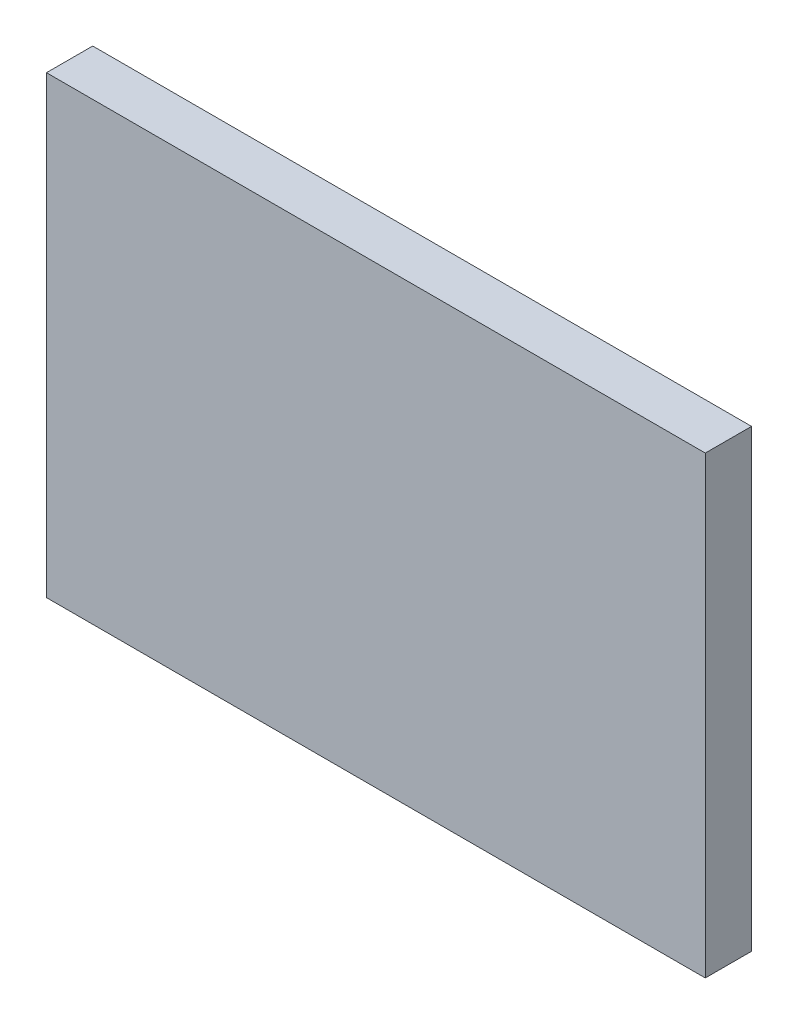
from build123d import *

# Parameters (mm, degrees)
ESQUISSE1_W      = 85.5
ESQUISSE1_H      = 59
EXTRUSION1_DEPTH = 6


with BuildPart() as part:
    # Esquisse1 → Extrusion1 (new body)
    with BuildSketch(Plane.XY):
        with Locations((-27.25, 10.5)):
            Rectangle(ESQUISSE1_W, ESQUISSE1_H)
    extrude(amount=EXTRUSION1_DEPTH)


solid = part.part
